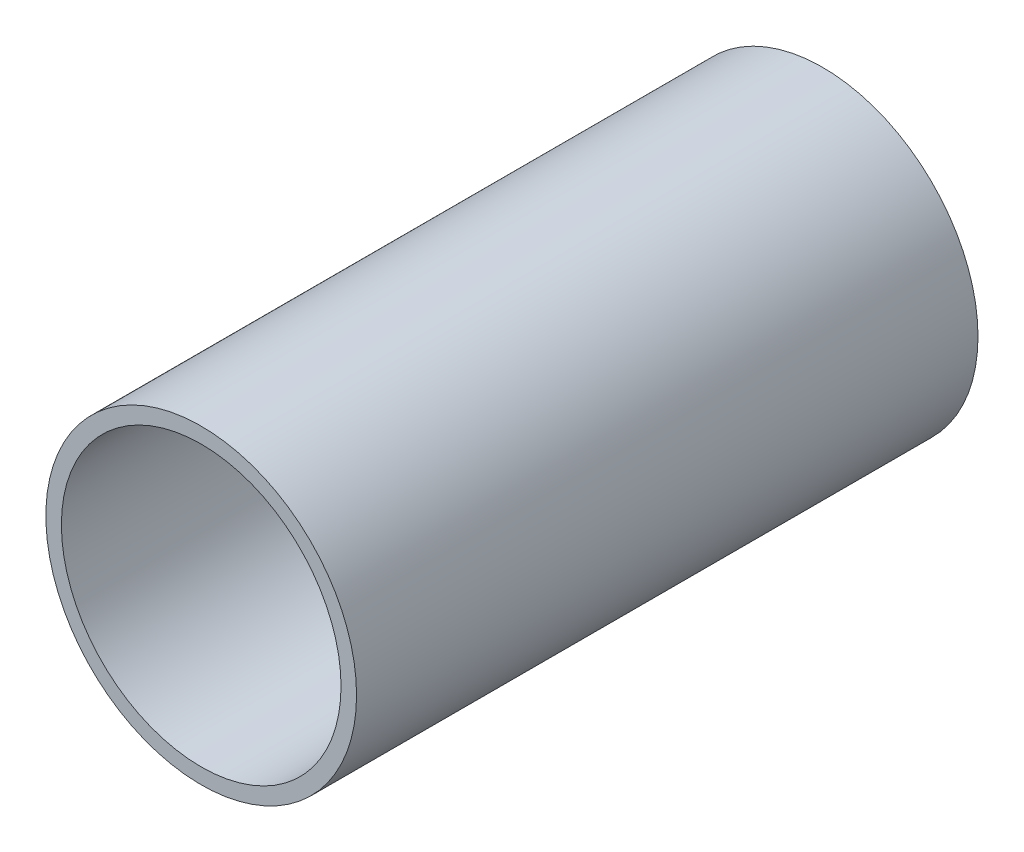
ISO-10303-21;
HEADER;
FILE_DESCRIPTION(('STEP AP214'),'2;1');
FILE_NAME('part.step','',(''),(''),'','','');
FILE_SCHEMA(('AUTOMOTIVE_DESIGN { 1 0 10303 214 1 1 1 1 }'));
ENDSEC;
DATA;
#1=APPLICATION_CONTEXT('core data for automotive mechanical design processes');
#2=APPLICATION_PROTOCOL_DEFINITION('international standard','automotive_design',2000,#1);
#3=PRODUCT_CONTEXT('',#1,'mechanical');
#4=PRODUCT('Part','Part','',(#3));
#5=PRODUCT_RELATED_PRODUCT_CATEGORY('part','',(#4));
#6=PRODUCT_DEFINITION_FORMATION('','',#4);
#7=PRODUCT_DEFINITION_CONTEXT('part definition',#1,'design');
#8=PRODUCT_DEFINITION('design','',#6,#7);
#9=PRODUCT_DEFINITION_SHAPE('','',#8);
#10=(LENGTH_UNIT() NAMED_UNIT(*) SI_UNIT(.MILLI.,.METRE.));
#11=(NAMED_UNIT(*) PLANE_ANGLE_UNIT() SI_UNIT($,.RADIAN.));
#12=(NAMED_UNIT(*) SI_UNIT($,.STERADIAN.) SOLID_ANGLE_UNIT());
#13=UNCERTAINTY_MEASURE_WITH_UNIT(LENGTH_MEASURE(1.E-05),#10,'distance_accuracy_value','');
#14=(GEOMETRIC_REPRESENTATION_CONTEXT(3) GLOBAL_UNCERTAINTY_ASSIGNED_CONTEXT((#13)) GLOBAL_UNIT_ASSIGNED_CONTEXT((#10,
#11,#12)) REPRESENTATION_CONTEXT('',''));
#15=CARTESIAN_POINT('',(0.,0.,0.));
#16=DIRECTION('',(0.,0.,1.));
#17=DIRECTION('',(1.,0.,0.));
#18=AXIS2_PLACEMENT_3D('',#15,#16,#17);
#19=CARTESIAN_POINT('',(0.,0.,1000.));
#20=DIRECTION('',(0.,0.,1.));
#21=DIRECTION('',(1.,0.,0.));
#22=AXIS2_PLACEMENT_3D('',#19,#20,#21);
#23=PLANE('',#22);
#24=CARTESIAN_POINT('',(0.,0.,1000.));
#25=DIRECTION('',(0.,0.,1.));
#26=DIRECTION('',(1.,0.,0.));
#27=AXIS2_PLACEMENT_3D('',#24,#25,#26);
#28=CIRCLE('',#27,250.);
#29=CARTESIAN_POINT('',(250.,0.,1000.));
#30=VERTEX_POINT('',#29);
#31=EDGE_CURVE('E10',#30,#30,#28,.T.);
#32=ORIENTED_EDGE('',*,*,#31,.T.);
#33=EDGE_LOOP('',(#32));
#34=FACE_BOUND('',#33,.T.);
#35=CARTESIAN_POINT('',(0.,0.,1000.));
#36=DIRECTION('',(0.,0.,1.));
#37=DIRECTION('',(1.,0.,0.));
#38=AXIS2_PLACEMENT_3D('',#35,#36,#37);
#39=CIRCLE('',#38,225.);
#40=CARTESIAN_POINT('',(225.,0.,1000.));
#41=VERTEX_POINT('',#40);
#42=EDGE_CURVE('E45',#41,#41,#39,.T.);
#43=ORIENTED_EDGE('',*,*,#42,.F.);
#44=EDGE_LOOP('',(#43));
#45=FACE_BOUND('',#44,.T.);
#46=ADVANCED_FACE('F34',(#34,#45),#23,.T.);
#47=CARTESIAN_POINT('',(0.,0.,0.));
#48=DIRECTION('',(0.,0.,1.));
#49=DIRECTION('',(1.,0.,0.));
#50=AXIS2_PLACEMENT_3D('',#47,#48,#49);
#51=PLANE('',#50);
#52=CARTESIAN_POINT('',(0.,0.,0.));
#53=DIRECTION('',(0.,0.,1.));
#54=DIRECTION('',(1.,0.,0.));
#55=AXIS2_PLACEMENT_3D('',#52,#53,#54);
#56=CIRCLE('',#55,250.);
#57=CARTESIAN_POINT('',(250.,0.,0.));
#58=VERTEX_POINT('',#57);
#59=EDGE_CURVE('E38',#58,#58,#56,.T.);
#60=ORIENTED_EDGE('',*,*,#59,.F.);
#61=EDGE_LOOP('',(#60));
#62=FACE_BOUND('',#61,.T.);
#63=CARTESIAN_POINT('',(0.,0.,0.));
#64=DIRECTION('',(0.,0.,1.));
#65=DIRECTION('',(1.,0.,0.));
#66=AXIS2_PLACEMENT_3D('',#63,#64,#65);
#67=CIRCLE('',#66,225.);
#68=CARTESIAN_POINT('',(225.,0.,0.));
#69=VERTEX_POINT('',#68);
#70=EDGE_CURVE('E47',#69,#69,#67,.T.);
#71=ORIENTED_EDGE('',*,*,#70,.T.);
#72=EDGE_LOOP('',(#71));
#73=FACE_BOUND('',#72,.T.);
#74=ADVANCED_FACE('F57',(#62,#73),#51,.F.);
#75=CARTESIAN_POINT('',(0.,0.,1000.));
#76=DIRECTION('',(0.,0.,-1.));
#77=DIRECTION('',(-1.,0.,0.));
#78=AXIS2_PLACEMENT_3D('',#75,#76,#77);
#79=CYLINDRICAL_SURFACE('',#78,250.);
#80=ORIENTED_EDGE('',*,*,#31,.F.);
#81=EDGE_LOOP('',(#80));
#82=FACE_BOUND('',#81,.T.);
#83=ORIENTED_EDGE('',*,*,#59,.T.);
#84=EDGE_LOOP('',(#83));
#85=FACE_BOUND('',#84,.T.);
#86=ADVANCED_FACE('F36',(#82,#85),#79,.T.);
#87=CARTESIAN_POINT('',(0.,0.,1000.));
#88=DIRECTION('',(0.,0.,-1.));
#89=DIRECTION('',(-1.,0.,0.));
#90=AXIS2_PLACEMENT_3D('',#87,#88,#89);
#91=CYLINDRICAL_SURFACE('',#90,225.);
#92=ORIENTED_EDGE('',*,*,#42,.T.);
#93=EDGE_LOOP('',(#92));
#94=FACE_BOUND('',#93,.T.);
#95=ORIENTED_EDGE('',*,*,#70,.F.);
#96=EDGE_LOOP('',(#95));
#97=FACE_BOUND('',#96,.T.);
#98=ADVANCED_FACE('F53',(#94,#97),#91,.F.);
#99=CLOSED_SHELL('',(#46,#74,#86,#98));
#100=MANIFOLD_SOLID_BREP('B2',#99);
#101=ADVANCED_BREP_SHAPE_REPRESENTATION('',(#18,#100),#14);
#102=SHAPE_DEFINITION_REPRESENTATION(#9,#101);
ENDSEC;
END-ISO-10303-21;
